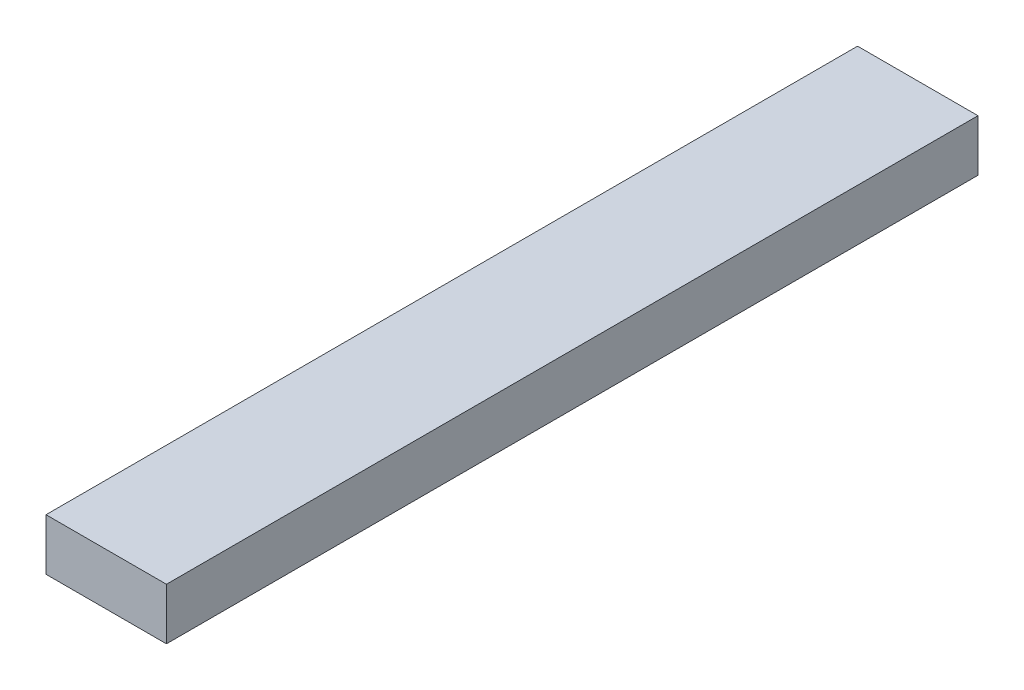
ISO-10303-21;
HEADER;
FILE_DESCRIPTION(('STEP AP214'),'2;1');
FILE_NAME('part.step','',(''),(''),'','','');
FILE_SCHEMA(('AUTOMOTIVE_DESIGN { 1 0 10303 214 1 1 1 1 }'));
ENDSEC;
DATA;
#1=APPLICATION_CONTEXT('core data for automotive mechanical design processes');
#2=APPLICATION_PROTOCOL_DEFINITION('international standard','automotive_design',2000,#1);
#3=PRODUCT_CONTEXT('',#1,'mechanical');
#4=PRODUCT('Part','Part','',(#3));
#5=PRODUCT_RELATED_PRODUCT_CATEGORY('part','',(#4));
#6=PRODUCT_DEFINITION_FORMATION('','',#4);
#7=PRODUCT_DEFINITION_CONTEXT('part definition',#1,'design');
#8=PRODUCT_DEFINITION('design','',#6,#7);
#9=PRODUCT_DEFINITION_SHAPE('','',#8);
#10=(LENGTH_UNIT() NAMED_UNIT(*) SI_UNIT(.MILLI.,.METRE.));
#11=(NAMED_UNIT(*) PLANE_ANGLE_UNIT() SI_UNIT($,.RADIAN.));
#12=(NAMED_UNIT(*) SI_UNIT($,.STERADIAN.) SOLID_ANGLE_UNIT());
#13=UNCERTAINTY_MEASURE_WITH_UNIT(LENGTH_MEASURE(1.E-05),#10,'distance_accuracy_value','');
#14=(GEOMETRIC_REPRESENTATION_CONTEXT(3) GLOBAL_UNCERTAINTY_ASSIGNED_CONTEXT((#13)) GLOBAL_UNIT_ASSIGNED_CONTEXT((#10,
#11,#12)) REPRESENTATION_CONTEXT('',''));
#15=CARTESIAN_POINT('',(0.,0.,0.));
#16=DIRECTION('',(0.,0.,1.));
#17=DIRECTION('',(1.,0.,0.));
#18=AXIS2_PLACEMENT_3D('',#15,#16,#17);
#19=CARTESIAN_POINT('',(-21.,-9.,283.));
#20=DIRECTION('',(1.,0.,0.));
#21=DIRECTION('',(0.,0.,-1.));
#22=AXIS2_PLACEMENT_3D('',#19,#20,#21);
#23=PLANE('',#22);
#24=DIRECTION('',(0.,-1.,0.));
#25=VECTOR('',#24,1.);
#26=CARTESIAN_POINT('',(-21.,-9.,0.));
#27=LINE('',#26,#25);
#28=CARTESIAN_POINT('',(-21.,9.,0.));
#29=VERTEX_POINT('',#28);
#30=CARTESIAN_POINT('',(-21.,-9.,0.));
#31=VERTEX_POINT('',#30);
#32=EDGE_CURVE('E96',#29,#31,#27,.T.);
#33=ORIENTED_EDGE('',*,*,#32,.T.);
#34=DIRECTION('',(0.,0.,-1.));
#35=VECTOR('',#34,1.);
#36=CARTESIAN_POINT('',(-21.,-9.,283.));
#37=LINE('',#36,#35);
#38=CARTESIAN_POINT('',(-21.,-9.,283.));
#39=VERTEX_POINT('',#38);
#40=EDGE_CURVE('E11',#39,#31,#37,.T.);
#41=ORIENTED_EDGE('',*,*,#40,.F.);
#42=DIRECTION('',(0.,-1.,0.));
#43=VECTOR('',#42,1.);
#44=CARTESIAN_POINT('',(-21.,-9.,283.));
#45=LINE('',#44,#43);
#46=CARTESIAN_POINT('',(-21.,9.,283.));
#47=VERTEX_POINT('',#46);
#48=EDGE_CURVE('E84',#47,#39,#45,.T.);
#49=ORIENTED_EDGE('',*,*,#48,.F.);
#50=DIRECTION('',(0.,0.,-1.));
#51=VECTOR('',#50,1.);
#52=CARTESIAN_POINT('',(-21.,9.,283.));
#53=LINE('',#52,#51);
#54=EDGE_CURVE('E92',#47,#29,#53,.T.);
#55=ORIENTED_EDGE('',*,*,#54,.T.);
#56=EDGE_LOOP('',(#33,#41,#49,#55));
#57=FACE_BOUND('',#56,.T.);
#58=ADVANCED_FACE('F33',(#57),#23,.F.);
#59=CARTESIAN_POINT('',(21.,-9.,283.));
#60=DIRECTION('',(0.,1.,0.));
#61=DIRECTION('',(-1.,0.,0.));
#62=AXIS2_PLACEMENT_3D('',#59,#60,#61);
#63=PLANE('',#62);
#64=DIRECTION('',(1.,0.,0.));
#65=VECTOR('',#64,1.);
#66=CARTESIAN_POINT('',(21.,-9.,0.));
#67=LINE('',#66,#65);
#68=CARTESIAN_POINT('',(21.,-9.,0.));
#69=VERTEX_POINT('',#68);
#70=EDGE_CURVE('E88',#31,#69,#67,.T.);
#71=ORIENTED_EDGE('',*,*,#70,.T.);
#72=DIRECTION('',(0.,0.,-1.));
#73=VECTOR('',#72,1.);
#74=CARTESIAN_POINT('',(21.,-9.,283.));
#75=LINE('',#74,#73);
#76=CARTESIAN_POINT('',(21.,-9.,283.));
#77=VERTEX_POINT('',#76);
#78=EDGE_CURVE('E41',#77,#69,#75,.T.);
#79=ORIENTED_EDGE('',*,*,#78,.F.);
#80=DIRECTION('',(1.,0.,0.));
#81=VECTOR('',#80,1.);
#82=CARTESIAN_POINT('',(21.,-9.,283.));
#83=LINE('',#82,#81);
#84=EDGE_CURVE('E79',#39,#77,#83,.T.);
#85=ORIENTED_EDGE('',*,*,#84,.F.);
#86=ORIENTED_EDGE('',*,*,#40,.T.);
#87=EDGE_LOOP('',(#71,#79,#85,#86));
#88=FACE_BOUND('',#87,.T.);
#89=ADVANCED_FACE('F87',(#88),#63,.F.);
#90=CARTESIAN_POINT('',(21.,-9.,283.));
#91=DIRECTION('',(-1.,0.,0.));
#92=DIRECTION('',(0.,0.,1.));
#93=AXIS2_PLACEMENT_3D('',#90,#91,#92);
#94=PLANE('',#93);
#95=DIRECTION('',(0.,1.,0.));
#96=VECTOR('',#95,1.);
#97=CARTESIAN_POINT('',(21.,-9.,0.));
#98=LINE('',#97,#96);
#99=CARTESIAN_POINT('',(21.,9.,0.));
#100=VERTEX_POINT('',#99);
#101=EDGE_CURVE('E66',#69,#100,#98,.T.);
#102=ORIENTED_EDGE('',*,*,#101,.T.);
#103=DIRECTION('',(0.,0.,-1.));
#104=VECTOR('',#103,1.);
#105=CARTESIAN_POINT('',(21.,9.,283.));
#106=LINE('',#105,#104);
#107=CARTESIAN_POINT('',(21.,9.,283.));
#108=VERTEX_POINT('',#107);
#109=EDGE_CURVE('E89',#108,#100,#106,.T.);
#110=ORIENTED_EDGE('',*,*,#109,.F.);
#111=DIRECTION('',(0.,1.,0.));
#112=VECTOR('',#111,1.);
#113=CARTESIAN_POINT('',(21.,-9.,283.));
#114=LINE('',#113,#112);
#115=EDGE_CURVE('E82',#77,#108,#114,.T.);
#116=ORIENTED_EDGE('',*,*,#115,.F.);
#117=ORIENTED_EDGE('',*,*,#78,.T.);
#118=EDGE_LOOP('',(#102,#110,#116,#117));
#119=FACE_BOUND('',#118,.T.);
#120=ADVANCED_FACE('F90',(#119),#94,.F.);
#121=CARTESIAN_POINT('',(21.,9.,283.));
#122=DIRECTION('',(0.,-1.,0.));
#123=DIRECTION('',(1.,0.,0.));
#124=AXIS2_PLACEMENT_3D('',#121,#122,#123);
#125=PLANE('',#124);
#126=DIRECTION('',(-1.,0.,0.));
#127=VECTOR('',#126,1.);
#128=CARTESIAN_POINT('',(21.,9.,0.));
#129=LINE('',#128,#127);
#130=EDGE_CURVE('E72',#100,#29,#129,.T.);
#131=ORIENTED_EDGE('',*,*,#130,.T.);
#132=ORIENTED_EDGE('',*,*,#54,.F.);
#133=DIRECTION('',(-1.,0.,0.));
#134=VECTOR('',#133,1.);
#135=CARTESIAN_POINT('',(21.,9.,283.));
#136=LINE('',#135,#134);
#137=EDGE_CURVE('E49',#108,#47,#136,.T.);
#138=ORIENTED_EDGE('',*,*,#137,.F.);
#139=ORIENTED_EDGE('',*,*,#109,.T.);
#140=EDGE_LOOP('',(#131,#132,#138,#139));
#141=FACE_BOUND('',#140,.T.);
#142=ADVANCED_FACE('F103',(#141),#125,.F.);
#143=CARTESIAN_POINT('',(0.,0.,283.));
#144=DIRECTION('',(0.,0.,1.));
#145=DIRECTION('',(1.,0.,0.));
#146=AXIS2_PLACEMENT_3D('',#143,#144,#145);
#147=PLANE('',#146);
#148=ORIENTED_EDGE('',*,*,#48,.T.);
#149=ORIENTED_EDGE('',*,*,#84,.T.);
#150=ORIENTED_EDGE('',*,*,#115,.T.);
#151=ORIENTED_EDGE('',*,*,#137,.T.);
#152=EDGE_LOOP('',(#148,#149,#150,#151));
#153=FACE_BOUND('',#152,.T.);
#154=ADVANCED_FACE('F80',(#153),#147,.T.);
#155=CARTESIAN_POINT('',(0.,0.,0.));
#156=DIRECTION('',(0.,0.,1.));
#157=DIRECTION('',(1.,0.,0.));
#158=AXIS2_PLACEMENT_3D('',#155,#156,#157);
#159=PLANE('',#158);
#160=ORIENTED_EDGE('',*,*,#32,.F.);
#161=ORIENTED_EDGE('',*,*,#130,.F.);
#162=ORIENTED_EDGE('',*,*,#101,.F.);
#163=ORIENTED_EDGE('',*,*,#70,.F.);
#164=EDGE_LOOP('',(#160,#161,#162,#163));
#165=FACE_BOUND('',#164,.T.);
#166=ADVANCED_FACE('F106',(#165),#159,.F.);
#167=CLOSED_SHELL('',(#58,#89,#120,#142,#154,#166));
#168=MANIFOLD_SOLID_BREP('B2',#167);
#169=ADVANCED_BREP_SHAPE_REPRESENTATION('',(#18,#168),#14);
#170=SHAPE_DEFINITION_REPRESENTATION(#9,#169);
ENDSEC;
END-ISO-10303-21;
